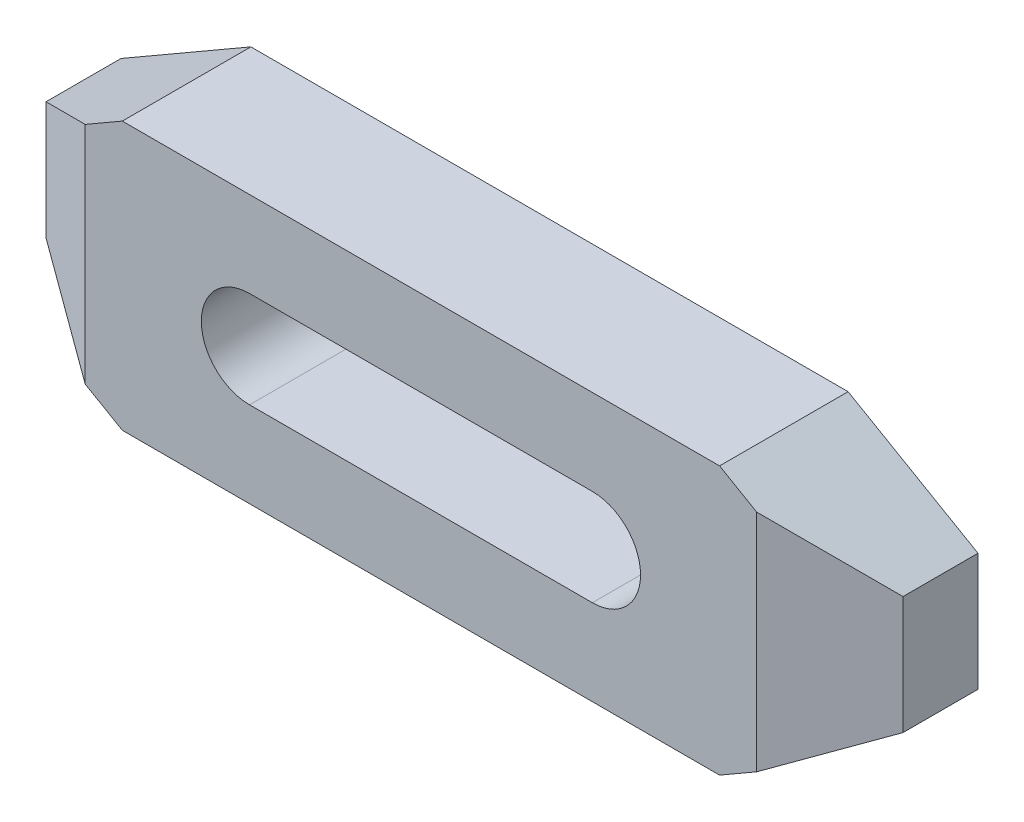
ISO-10303-21;
HEADER;
FILE_DESCRIPTION(('STEP AP214'),'2;1');
FILE_NAME('part.step','',(''),(''),'','','');
FILE_SCHEMA(('AUTOMOTIVE_DESIGN { 1 0 10303 214 1 1 1 1 }'));
ENDSEC;
DATA;
#1=APPLICATION_CONTEXT('core data for automotive mechanical design processes');
#2=APPLICATION_PROTOCOL_DEFINITION('international standard','automotive_design',2000,#1);
#3=PRODUCT_CONTEXT('',#1,'mechanical');
#4=PRODUCT('Part','Part','',(#3));
#5=PRODUCT_RELATED_PRODUCT_CATEGORY('part','',(#4));
#6=PRODUCT_DEFINITION_FORMATION('','',#4);
#7=PRODUCT_DEFINITION_CONTEXT('part definition',#1,'design');
#8=PRODUCT_DEFINITION('design','',#6,#7);
#9=PRODUCT_DEFINITION_SHAPE('','',#8);
#10=(LENGTH_UNIT() NAMED_UNIT(*) SI_UNIT(.MILLI.,.METRE.));
#11=(NAMED_UNIT(*) PLANE_ANGLE_UNIT() SI_UNIT($,.RADIAN.));
#12=(NAMED_UNIT(*) SI_UNIT($,.STERADIAN.) SOLID_ANGLE_UNIT());
#13=UNCERTAINTY_MEASURE_WITH_UNIT(LENGTH_MEASURE(1.E-05),#10,'distance_accuracy_value','');
#14=(GEOMETRIC_REPRESENTATION_CONTEXT(3) GLOBAL_UNCERTAINTY_ASSIGNED_CONTEXT((#13)) GLOBAL_UNIT_ASSIGNED_CONTEXT((#10,
#11,#12)) REPRESENTATION_CONTEXT('',''));
#15=CARTESIAN_POINT('',(0.,0.,0.));
#16=DIRECTION('',(0.,0.,1.));
#17=DIRECTION('',(1.,0.,0.));
#18=AXIS2_PLACEMENT_3D('',#15,#16,#17);
#19=CARTESIAN_POINT('',(0.,-28.5940107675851,12.));
#20=DIRECTION('',(0.,0.,-1.));
#21=DIRECTION('',(-1.,0.,0.));
#22=AXIS2_PLACEMENT_3D('',#19,#20,#21);
#23=PLANE('',#22);
#24=CARTESIAN_POINT('',(16.,0.,12.));
#25=DIRECTION('',(0.,0.,1.));
#26=DIRECTION('',(1.,0.,0.));
#27=AXIS2_PLACEMENT_3D('',#24,#25,#26);
#28=CIRCLE('',#27,4.5);
#29=CARTESIAN_POINT('',(16.,-4.5,12.));
#30=VERTEX_POINT('',#29);
#31=CARTESIAN_POINT('',(16.,4.5,12.));
#32=VERTEX_POINT('',#31);
#33=EDGE_CURVE('E221',#30,#32,#28,.T.);
#34=ORIENTED_EDGE('',*,*,#33,.F.);
#35=DIRECTION('',(-1.,0.,0.));
#36=VECTOR('',#35,1.);
#37=CARTESIAN_POINT('',(16.,-4.5,12.));
#38=LINE('',#37,#36);
#39=CARTESIAN_POINT('',(-16.,-4.5,12.));
#40=VERTEX_POINT('',#39);
#41=EDGE_CURVE('E220',#30,#40,#38,.T.);
#42=ORIENTED_EDGE('',*,*,#41,.T.);
#43=CARTESIAN_POINT('',(-16.,0.,12.));
#44=DIRECTION('',(0.,0.,1.));
#45=DIRECTION('',(1.,0.,0.));
#46=AXIS2_PLACEMENT_3D('',#43,#44,#45);
#47=CIRCLE('',#46,4.5);
#48=CARTESIAN_POINT('',(-16.,4.5,12.));
#49=VERTEX_POINT('',#48);
#50=EDGE_CURVE('E228',#49,#40,#47,.T.);
#51=ORIENTED_EDGE('',*,*,#50,.F.);
#52=DIRECTION('',(-1.,0.,0.));
#53=VECTOR('',#52,1.);
#54=CARTESIAN_POINT('',(16.,4.5,12.));
#55=LINE('',#54,#53);
#56=EDGE_CURVE('E224',#32,#49,#55,.T.);
#57=ORIENTED_EDGE('',*,*,#56,.F.);
#58=EDGE_LOOP('',(#34,#42,#51,#57));
#59=FACE_BOUND('',#58,.T.);
#60=DIRECTION('',(0.,1.,0.));
#61=VECTOR('',#60,1.);
#62=CARTESIAN_POINT('',(-31.3397459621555,-28.5940107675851,12.));
#63=LINE('',#62,#61);
#64=CARTESIAN_POINT('',(-31.3397459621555,-10.5,12.));
#65=VERTEX_POINT('',#64);
#66=CARTESIAN_POINT('',(-31.3397459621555,10.5,12.));
#67=VERTEX_POINT('',#66);
#68=EDGE_CURVE('E115',#65,#67,#63,.T.);
#69=ORIENTED_EDGE('',*,*,#68,.F.);
#70=DIRECTION('',(-0.866025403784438,0.5,0.));
#71=VECTOR('',#70,1.);
#72=CARTESIAN_POINT('',(-27.8756443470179,-12.5,12.));
#73=LINE('',#72,#71);
#74=CARTESIAN_POINT('',(-27.8756443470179,-12.5,12.));
#75=VERTEX_POINT('',#74);
#76=EDGE_CURVE('E174',#75,#65,#73,.T.);
#77=ORIENTED_EDGE('',*,*,#76,.F.);
#78=DIRECTION('',(-1.,0.,0.));
#79=VECTOR('',#78,1.);
#80=CARTESIAN_POINT('',(27.8756443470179,-12.5,12.));
#81=LINE('',#80,#79);
#82=CARTESIAN_POINT('',(27.8756443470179,-12.5,12.));
#83=VERTEX_POINT('',#82);
#84=EDGE_CURVE('E177',#83,#75,#81,.T.);
#85=ORIENTED_EDGE('',*,*,#84,.F.);
#86=DIRECTION('',(-0.866025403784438,-0.5,0.));
#87=VECTOR('',#86,1.);
#88=CARTESIAN_POINT('',(40.,-5.5,12.));
#89=LINE('',#88,#87);
#90=CARTESIAN_POINT('',(31.3397459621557,-10.5,12.));
#91=VERTEX_POINT('',#90);
#92=EDGE_CURVE('E157',#91,#83,#89,.T.);
#93=ORIENTED_EDGE('',*,*,#92,.F.);
#94=DIRECTION('',(0.,1.,0.));
#95=VECTOR('',#94,1.);
#96=CARTESIAN_POINT('',(31.3397459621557,-28.5940107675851,12.));
#97=LINE('',#96,#95);
#98=CARTESIAN_POINT('',(31.3397459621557,10.5,12.));
#99=VERTEX_POINT('',#98);
#100=EDGE_CURVE('E146',#91,#99,#97,.T.);
#101=ORIENTED_EDGE('',*,*,#100,.T.);
#102=DIRECTION('',(0.866025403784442,-0.5,0.));
#103=VECTOR('',#102,1.);
#104=CARTESIAN_POINT('',(27.8756443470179,12.5,12.));
#105=LINE('',#104,#103);
#106=CARTESIAN_POINT('',(27.8756443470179,12.5,12.));
#107=VERTEX_POINT('',#106);
#108=EDGE_CURVE('E155',#107,#99,#105,.T.);
#109=ORIENTED_EDGE('',*,*,#108,.F.);
#110=DIRECTION('',(1.,0.,0.));
#111=VECTOR('',#110,1.);
#112=CARTESIAN_POINT('',(-27.8756443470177,12.5,12.));
#113=LINE('',#112,#111);
#114=CARTESIAN_POINT('',(-27.8756443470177,12.5,12.));
#115=VERTEX_POINT('',#114);
#116=EDGE_CURVE('E164',#115,#107,#113,.T.);
#117=ORIENTED_EDGE('',*,*,#116,.F.);
#118=DIRECTION('',(0.866025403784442,0.5,0.));
#119=VECTOR('',#118,1.);
#120=CARTESIAN_POINT('',(-40.,5.5,12.));
#121=LINE('',#120,#119);
#122=EDGE_CURVE('E167',#67,#115,#121,.T.);
#123=ORIENTED_EDGE('',*,*,#122,.F.);
#124=EDGE_LOOP('',(#69,#77,#85,#93,#101,#109,#117,#123));
#125=FACE_BOUND('',#124,.T.);
#126=ADVANCED_FACE('F14',(#59,#125),#23,.F.);
#127=CARTESIAN_POINT('',(-40.,5.5,12.));
#128=DIRECTION('',(-0.5,0.866025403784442,0.));
#129=DIRECTION('',(-0.866025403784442,-0.5,0.));
#130=AXIS2_PLACEMENT_3D('',#127,#128,#129);
#131=PLANE('',#130);
#132=DIRECTION('',(0.,0.,-1.));
#133=VECTOR('',#132,1.);
#134=CARTESIAN_POINT('',(-40.,5.5,12.));
#135=LINE('',#134,#133);
#136=CARTESIAN_POINT('',(-40.,5.5,7.));
#137=VERTEX_POINT('',#136);
#138=CARTESIAN_POINT('',(-40.,5.5,0.));
#139=VERTEX_POINT('',#138);
#140=EDGE_CURVE('E124',#137,#139,#135,.T.);
#141=ORIENTED_EDGE('',*,*,#140,.F.);
#142=DIRECTION('',(0.774596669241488,0.447213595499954,0.447213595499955));
#143=VECTOR('',#142,1.);
#144=CARTESIAN_POINT('',(-38.2679491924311,6.5,8.));
#145=LINE('',#144,#143);
#146=EDGE_CURVE('E112',#137,#67,#145,.T.);
#147=ORIENTED_EDGE('',*,*,#146,.T.);
#148=ORIENTED_EDGE('',*,*,#122,.T.);
#149=DIRECTION('',(0.,0.,-1.));
#150=VECTOR('',#149,1.);
#151=CARTESIAN_POINT('',(-27.8756443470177,12.5,12.));
#152=LINE('',#151,#150);
#153=CARTESIAN_POINT('',(-27.8756443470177,12.5,0.));
#154=VERTEX_POINT('',#153);
#155=EDGE_CURVE('E132',#115,#154,#152,.T.);
#156=ORIENTED_EDGE('',*,*,#155,.T.);
#157=DIRECTION('',(0.866025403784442,0.5,0.));
#158=VECTOR('',#157,1.);
#159=CARTESIAN_POINT('',(-40.,5.5,0.));
#160=LINE('',#159,#158);
#161=EDGE_CURVE('E131',#139,#154,#160,.T.);
#162=ORIENTED_EDGE('',*,*,#161,.F.);
#163=EDGE_LOOP('',(#141,#147,#148,#156,#162));
#164=FACE_BOUND('',#163,.T.);
#165=ADVANCED_FACE('F129',(#164),#131,.T.);
#166=CARTESIAN_POINT('',(-40.,-5.5,12.));
#167=DIRECTION('',(-1.,0.,0.));
#168=DIRECTION('',(0.,0.,1.));
#169=AXIS2_PLACEMENT_3D('',#166,#167,#168);
#170=PLANE('',#169);
#171=DIRECTION('',(0.,0.,-1.));
#172=VECTOR('',#171,1.);
#173=CARTESIAN_POINT('',(-40.,-5.5,12.));
#174=LINE('',#173,#172);
#175=CARTESIAN_POINT('',(-40.,-5.5,7.));
#176=VERTEX_POINT('',#175);
#177=CARTESIAN_POINT('',(-40.,-5.5,0.));
#178=VERTEX_POINT('',#177);
#179=EDGE_CURVE('E126',#176,#178,#174,.T.);
#180=ORIENTED_EDGE('',*,*,#179,.F.);
#181=DIRECTION('',(0.,1.,0.));
#182=VECTOR('',#181,1.);
#183=CARTESIAN_POINT('',(-40.,-13.,7.));
#184=LINE('',#183,#182);
#185=EDGE_CURVE('E29',#176,#137,#184,.T.);
#186=ORIENTED_EDGE('',*,*,#185,.T.);
#187=ORIENTED_EDGE('',*,*,#140,.T.);
#188=DIRECTION('',(0.,1.,0.));
#189=VECTOR('',#188,1.);
#190=CARTESIAN_POINT('',(-40.,-5.5,0.));
#191=LINE('',#190,#189);
#192=EDGE_CURVE('E199',#178,#139,#191,.T.);
#193=ORIENTED_EDGE('',*,*,#192,.F.);
#194=EDGE_LOOP('',(#180,#186,#187,#193));
#195=FACE_BOUND('',#194,.T.);
#196=ADVANCED_FACE('F122',(#195),#170,.T.);
#197=CARTESIAN_POINT('',(-27.8756443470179,-12.5,12.));
#198=DIRECTION('',(-0.5,-0.866025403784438,0.));
#199=DIRECTION('',(0.866025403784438,-0.5,0.));
#200=AXIS2_PLACEMENT_3D('',#197,#198,#199);
#201=PLANE('',#200);
#202=ORIENTED_EDGE('',*,*,#76,.T.);
#203=DIRECTION('',(-0.774596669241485,0.44721359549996,-0.447213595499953));
#204=VECTOR('',#203,1.);
#205=CARTESIAN_POINT('',(-28.5684646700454,-12.1,13.6));
#206=LINE('',#205,#204);
#207=EDGE_CURVE('E9',#65,#176,#206,.T.);
#208=ORIENTED_EDGE('',*,*,#207,.T.);
#209=ORIENTED_EDGE('',*,*,#179,.T.);
#210=DIRECTION('',(-0.866025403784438,0.5,0.));
#211=VECTOR('',#210,1.);
#212=CARTESIAN_POINT('',(-27.8756443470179,-12.5,0.));
#213=LINE('',#212,#211);
#214=CARTESIAN_POINT('',(-27.8756443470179,-12.5,0.));
#215=VERTEX_POINT('',#214);
#216=EDGE_CURVE('E195',#215,#178,#213,.T.);
#217=ORIENTED_EDGE('',*,*,#216,.F.);
#218=DIRECTION('',(0.,0.,-1.));
#219=VECTOR('',#218,1.);
#220=CARTESIAN_POINT('',(-27.8756443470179,-12.5,12.));
#221=LINE('',#220,#219);
#222=EDGE_CURVE('E136',#75,#215,#221,.T.);
#223=ORIENTED_EDGE('',*,*,#222,.F.);
#224=EDGE_LOOP('',(#202,#208,#209,#217,#223));
#225=FACE_BOUND('',#224,.T.);
#226=ADVANCED_FACE('F198',(#225),#201,.T.);
#227=CARTESIAN_POINT('',(0.,-28.5940107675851,0.));
#228=DIRECTION('',(0.,0.,-1.));
#229=DIRECTION('',(-1.,0.,0.));
#230=AXIS2_PLACEMENT_3D('',#227,#228,#229);
#231=PLANE('',#230);
#232=DIRECTION('',(-0.866025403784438,-0.5,0.));
#233=VECTOR('',#232,1.);
#234=CARTESIAN_POINT('',(40.,-5.5,0.));
#235=LINE('',#234,#233);
#236=CARTESIAN_POINT('',(40.,-5.5,0.));
#237=VERTEX_POINT('',#236);
#238=CARTESIAN_POINT('',(27.8756443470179,-12.5,0.));
#239=VERTEX_POINT('',#238);
#240=EDGE_CURVE('E170',#237,#239,#235,.T.);
#241=ORIENTED_EDGE('',*,*,#240,.T.);
#242=DIRECTION('',(-1.,0.,0.));
#243=VECTOR('',#242,1.);
#244=CARTESIAN_POINT('',(27.8756443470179,-12.5,0.));
#245=LINE('',#244,#243);
#246=EDGE_CURVE('E186',#239,#215,#245,.T.);
#247=ORIENTED_EDGE('',*,*,#246,.T.);
#248=ORIENTED_EDGE('',*,*,#216,.T.);
#249=ORIENTED_EDGE('',*,*,#192,.T.);
#250=ORIENTED_EDGE('',*,*,#161,.T.);
#251=DIRECTION('',(1.,0.,0.));
#252=VECTOR('',#251,1.);
#253=CARTESIAN_POINT('',(-27.8756443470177,12.5,0.));
#254=LINE('',#253,#252);
#255=CARTESIAN_POINT('',(27.8756443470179,12.5,0.));
#256=VERTEX_POINT('',#255);
#257=EDGE_CURVE('E204',#154,#256,#254,.T.);
#258=ORIENTED_EDGE('',*,*,#257,.T.);
#259=DIRECTION('',(0.866025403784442,-0.5,0.));
#260=VECTOR('',#259,1.);
#261=CARTESIAN_POINT('',(27.8756443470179,12.5,0.));
#262=LINE('',#261,#260);
#263=CARTESIAN_POINT('',(40.,5.50000000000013,0.));
#264=VERTEX_POINT('',#263);
#265=EDGE_CURVE('E207',#256,#264,#262,.T.);
#266=ORIENTED_EDGE('',*,*,#265,.T.);
#267=DIRECTION('',(0.,-1.,0.));
#268=VECTOR('',#267,1.);
#269=CARTESIAN_POINT('',(40.,5.50000000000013,0.));
#270=LINE('',#269,#268);
#271=EDGE_CURVE('E180',#264,#237,#270,.T.);
#272=ORIENTED_EDGE('',*,*,#271,.T.);
#273=EDGE_LOOP('',(#241,#247,#248,#249,#250,#258,#266,#272));
#274=FACE_BOUND('',#273,.T.);
#275=DIRECTION('',(-1.,0.,0.));
#276=VECTOR('',#275,1.);
#277=CARTESIAN_POINT('',(16.,-4.5,0.));
#278=LINE('',#277,#276);
#279=CARTESIAN_POINT('',(16.,-4.5,0.));
#280=VERTEX_POINT('',#279);
#281=CARTESIAN_POINT('',(-16.,-4.5,0.));
#282=VERTEX_POINT('',#281);
#283=EDGE_CURVE('E225',#280,#282,#278,.T.);
#284=ORIENTED_EDGE('',*,*,#283,.F.);
#285=CARTESIAN_POINT('',(16.,0.,0.));
#286=DIRECTION('',(0.,0.,1.));
#287=DIRECTION('',(1.,0.,0.));
#288=AXIS2_PLACEMENT_3D('',#285,#286,#287);
#289=CIRCLE('',#288,4.5);
#290=CARTESIAN_POINT('',(16.,4.5,0.));
#291=VERTEX_POINT('',#290);
#292=EDGE_CURVE('E232',#280,#291,#289,.T.);
#293=ORIENTED_EDGE('',*,*,#292,.T.);
#294=DIRECTION('',(-1.,0.,0.));
#295=VECTOR('',#294,1.);
#296=CARTESIAN_POINT('',(16.,4.5,0.));
#297=LINE('',#296,#295);
#298=CARTESIAN_POINT('',(-16.,4.5,0.));
#299=VERTEX_POINT('',#298);
#300=EDGE_CURVE('E235',#291,#299,#297,.T.);
#301=ORIENTED_EDGE('',*,*,#300,.T.);
#302=CARTESIAN_POINT('',(-16.,0.,0.));
#303=DIRECTION('',(0.,0.,1.));
#304=DIRECTION('',(1.,0.,0.));
#305=AXIS2_PLACEMENT_3D('',#302,#303,#304);
#306=CIRCLE('',#305,4.5);
#307=EDGE_CURVE('E238',#299,#282,#306,.T.);
#308=ORIENTED_EDGE('',*,*,#307,.T.);
#309=EDGE_LOOP('',(#284,#293,#301,#308));
#310=FACE_BOUND('',#309,.T.);
#311=ADVANCED_FACE('F193',(#274,#310),#231,.T.);
#312=CARTESIAN_POINT('',(40.,-5.5,12.));
#313=DIRECTION('',(0.5,-0.866025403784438,0.));
#314=DIRECTION('',(0.866025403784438,0.5,0.));
#315=AXIS2_PLACEMENT_3D('',#312,#313,#314);
#316=PLANE('',#315);
#317=DIRECTION('',(0.774596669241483,0.447213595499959,-0.447213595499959));
#318=VECTOR('',#317,1.);
#319=CARTESIAN_POINT('',(38.2679491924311,-6.5,8.));
#320=LINE('',#319,#318);
#321=CARTESIAN_POINT('',(40.,-5.5,7.));
#322=VERTEX_POINT('',#321);
#323=EDGE_CURVE('E158',#91,#322,#320,.T.);
#324=ORIENTED_EDGE('',*,*,#323,.F.);
#325=ORIENTED_EDGE('',*,*,#92,.T.);
#326=DIRECTION('',(0.,0.,-1.));
#327=VECTOR('',#326,1.);
#328=CARTESIAN_POINT('',(27.8756443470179,-12.5,12.));
#329=LINE('',#328,#327);
#330=EDGE_CURVE('E163',#83,#239,#329,.T.);
#331=ORIENTED_EDGE('',*,*,#330,.T.);
#332=ORIENTED_EDGE('',*,*,#240,.F.);
#333=DIRECTION('',(0.,0.,-1.));
#334=VECTOR('',#333,1.);
#335=CARTESIAN_POINT('',(40.,-5.5,12.));
#336=LINE('',#335,#334);
#337=EDGE_CURVE('E143',#322,#237,#336,.T.);
#338=ORIENTED_EDGE('',*,*,#337,.F.);
#339=EDGE_LOOP('',(#324,#325,#331,#332,#338));
#340=FACE_BOUND('',#339,.T.);
#341=ADVANCED_FACE('F249',(#340),#316,.T.);
#342=CARTESIAN_POINT('',(40.,5.50000000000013,12.));
#343=DIRECTION('',(1.,0.,0.));
#344=DIRECTION('',(0.,0.,-1.));
#345=AXIS2_PLACEMENT_3D('',#342,#343,#344);
#346=PLANE('',#345);
#347=DIRECTION('',(0.,1.,0.));
#348=VECTOR('',#347,1.);
#349=CARTESIAN_POINT('',(40.,-13.,7.));
#350=LINE('',#349,#348);
#351=CARTESIAN_POINT('',(40.,5.50000000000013,7.));
#352=VERTEX_POINT('',#351);
#353=EDGE_CURVE('E36',#322,#352,#350,.T.);
#354=ORIENTED_EDGE('',*,*,#353,.F.);
#355=ORIENTED_EDGE('',*,*,#337,.T.);
#356=ORIENTED_EDGE('',*,*,#271,.F.);
#357=DIRECTION('',(0.,0.,-1.));
#358=VECTOR('',#357,1.);
#359=CARTESIAN_POINT('',(40.,5.50000000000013,12.));
#360=LINE('',#359,#358);
#361=EDGE_CURVE('E141',#352,#264,#360,.T.);
#362=ORIENTED_EDGE('',*,*,#361,.F.);
#363=EDGE_LOOP('',(#354,#355,#356,#362));
#364=FACE_BOUND('',#363,.T.);
#365=ADVANCED_FACE('F16',(#364),#346,.T.);
#366=CARTESIAN_POINT('',(27.8756443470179,12.5,12.));
#367=DIRECTION('',(0.5,0.866025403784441,0.));
#368=DIRECTION('',(-0.866025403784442,0.5,0.));
#369=AXIS2_PLACEMENT_3D('',#366,#367,#368);
#370=PLANE('',#369);
#371=DIRECTION('',(-0.774596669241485,0.447213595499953,0.447213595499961));
#372=VECTOR('',#371,1.);
#373=CARTESIAN_POINT('',(28.5684646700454,12.1,13.6));
#374=LINE('',#373,#372);
#375=EDGE_CURVE('E22',#352,#99,#374,.T.);
#376=ORIENTED_EDGE('',*,*,#375,.F.);
#377=ORIENTED_EDGE('',*,*,#361,.T.);
#378=ORIENTED_EDGE('',*,*,#265,.F.);
#379=DIRECTION('',(0.,0.,-1.));
#380=VECTOR('',#379,1.);
#381=CARTESIAN_POINT('',(27.8756443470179,12.5,12.));
#382=LINE('',#381,#380);
#383=EDGE_CURVE('E134',#107,#256,#382,.T.);
#384=ORIENTED_EDGE('',*,*,#383,.F.);
#385=ORIENTED_EDGE('',*,*,#108,.T.);
#386=EDGE_LOOP('',(#376,#377,#378,#384,#385));
#387=FACE_BOUND('',#386,.T.);
#388=ADVANCED_FACE('F160',(#387),#370,.T.);
#389=CARTESIAN_POINT('',(-27.8756443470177,12.5,12.));
#390=DIRECTION('',(0.,1.,0.));
#391=DIRECTION('',(-1.,0.,0.));
#392=AXIS2_PLACEMENT_3D('',#389,#390,#391);
#393=PLANE('',#392);
#394=ORIENTED_EDGE('',*,*,#155,.F.);
#395=ORIENTED_EDGE('',*,*,#116,.T.);
#396=ORIENTED_EDGE('',*,*,#383,.T.);
#397=ORIENTED_EDGE('',*,*,#257,.F.);
#398=EDGE_LOOP('',(#394,#395,#396,#397));
#399=FACE_BOUND('',#398,.T.);
#400=ADVANCED_FACE('F253',(#399),#393,.T.);
#401=CARTESIAN_POINT('',(27.8756443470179,-12.5,12.));
#402=DIRECTION('',(0.,-1.,0.));
#403=DIRECTION('',(1.,0.,0.));
#404=AXIS2_PLACEMENT_3D('',#401,#402,#403);
#405=PLANE('',#404);
#406=ORIENTED_EDGE('',*,*,#84,.T.);
#407=ORIENTED_EDGE('',*,*,#222,.T.);
#408=ORIENTED_EDGE('',*,*,#246,.F.);
#409=ORIENTED_EDGE('',*,*,#330,.F.);
#410=EDGE_LOOP('',(#406,#407,#408,#409));
#411=FACE_BOUND('',#410,.T.);
#412=ADVANCED_FACE('F184',(#411),#405,.T.);
#413=CARTESIAN_POINT('',(16.,0.,12.));
#414=DIRECTION('',(0.,0.,-1.));
#415=DIRECTION('',(-1.,0.,0.));
#416=AXIS2_PLACEMENT_3D('',#413,#414,#415);
#417=CYLINDRICAL_SURFACE('',#416,4.5);
#418=DIRECTION('',(0.,0.,-1.));
#419=VECTOR('',#418,1.);
#420=CARTESIAN_POINT('',(16.,4.5,12.));
#421=LINE('',#420,#419);
#422=EDGE_CURVE('E211',#32,#291,#421,.T.);
#423=ORIENTED_EDGE('',*,*,#422,.T.);
#424=ORIENTED_EDGE('',*,*,#292,.F.);
#425=DIRECTION('',(0.,0.,-1.));
#426=VECTOR('',#425,1.);
#427=CARTESIAN_POINT('',(16.,-4.5,12.));
#428=LINE('',#427,#426);
#429=EDGE_CURVE('E217',#30,#280,#428,.T.);
#430=ORIENTED_EDGE('',*,*,#429,.F.);
#431=ORIENTED_EDGE('',*,*,#33,.T.);
#432=EDGE_LOOP('',(#423,#424,#430,#431));
#433=FACE_BOUND('',#432,.T.);
#434=ADVANCED_FACE('F261',(#433),#417,.F.);
#435=CARTESIAN_POINT('',(16.,4.5,12.));
#436=DIRECTION('',(0.,-1.,0.));
#437=DIRECTION('',(1.,0.,0.));
#438=AXIS2_PLACEMENT_3D('',#435,#436,#437);
#439=PLANE('',#438);
#440=DIRECTION('',(0.,0.,-1.));
#441=VECTOR('',#440,1.);
#442=CARTESIAN_POINT('',(-16.,4.5,12.));
#443=LINE('',#442,#441);
#444=EDGE_CURVE('E213',#49,#299,#443,.T.);
#445=ORIENTED_EDGE('',*,*,#444,.T.);
#446=ORIENTED_EDGE('',*,*,#300,.F.);
#447=ORIENTED_EDGE('',*,*,#422,.F.);
#448=ORIENTED_EDGE('',*,*,#56,.T.);
#449=EDGE_LOOP('',(#445,#446,#447,#448));
#450=FACE_BOUND('',#449,.T.);
#451=ADVANCED_FACE('F336',(#450),#439,.T.);
#452=CARTESIAN_POINT('',(-16.,0.,12.));
#453=DIRECTION('',(0.,0.,-1.));
#454=DIRECTION('',(-1.,0.,0.));
#455=AXIS2_PLACEMENT_3D('',#452,#453,#454);
#456=CYLINDRICAL_SURFACE('',#455,4.5);
#457=DIRECTION('',(0.,0.,-1.));
#458=VECTOR('',#457,1.);
#459=CARTESIAN_POINT('',(-16.,-4.5,12.));
#460=LINE('',#459,#458);
#461=EDGE_CURVE('E215',#40,#282,#460,.T.);
#462=ORIENTED_EDGE('',*,*,#461,.T.);
#463=ORIENTED_EDGE('',*,*,#307,.F.);
#464=ORIENTED_EDGE('',*,*,#444,.F.);
#465=ORIENTED_EDGE('',*,*,#50,.T.);
#466=EDGE_LOOP('',(#462,#463,#464,#465));
#467=FACE_BOUND('',#466,.T.);
#468=ADVANCED_FACE('F346',(#467),#456,.F.);
#469=CARTESIAN_POINT('',(16.,-4.5,12.));
#470=DIRECTION('',(0.,-1.,0.));
#471=DIRECTION('',(1.,0.,0.));
#472=AXIS2_PLACEMENT_3D('',#469,#470,#471);
#473=PLANE('',#472);
#474=ORIENTED_EDGE('',*,*,#41,.F.);
#475=ORIENTED_EDGE('',*,*,#429,.T.);
#476=ORIENTED_EDGE('',*,*,#283,.T.);
#477=ORIENTED_EDGE('',*,*,#461,.F.);
#478=EDGE_LOOP('',(#474,#475,#476,#477));
#479=FACE_BOUND('',#478,.T.);
#480=ADVANCED_FACE('F355',(#479),#473,.F.);
#481=CARTESIAN_POINT('',(40.,-13.,7.));
#482=DIRECTION('',(-0.5,0.,-0.866025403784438));
#483=DIRECTION('',(-0.866025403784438,0.,0.5));
#484=AXIS2_PLACEMENT_3D('',#481,#482,#483);
#485=PLANE('',#484);
#486=ORIENTED_EDGE('',*,*,#323,.T.);
#487=ORIENTED_EDGE('',*,*,#353,.T.);
#488=ORIENTED_EDGE('',*,*,#375,.T.);
#489=ORIENTED_EDGE('',*,*,#100,.F.);
#490=EDGE_LOOP('',(#486,#487,#488,#489));
#491=FACE_BOUND('',#490,.T.);
#492=ADVANCED_FACE('F145',(#491),#485,.F.);
#493=CARTESIAN_POINT('',(-40.,-13.,7.));
#494=DIRECTION('',(-0.5,0.,0.866025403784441));
#495=DIRECTION('',(0.866025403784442,0.,0.5));
#496=AXIS2_PLACEMENT_3D('',#493,#494,#495);
#497=PLANE('',#496);
#498=ORIENTED_EDGE('',*,*,#185,.F.);
#499=ORIENTED_EDGE('',*,*,#207,.F.);
#500=ORIENTED_EDGE('',*,*,#68,.T.);
#501=ORIENTED_EDGE('',*,*,#146,.F.);
#502=EDGE_LOOP('',(#498,#499,#500,#501));
#503=FACE_BOUND('',#502,.T.);
#504=ADVANCED_FACE('F113',(#503),#497,.T.);
#505=CLOSED_SHELL('',(#126,#165,#196,#226,#311,#341,#365,#388,#400,#412,#434,#451,#468,#480,
#492,#504));
#506=MANIFOLD_SOLID_BREP('B1',#505);
#507=ADVANCED_BREP_SHAPE_REPRESENTATION('',(#18,#506),#14);
#508=SHAPE_DEFINITION_REPRESENTATION(#9,#507);
ENDSEC;
END-ISO-10303-21;
